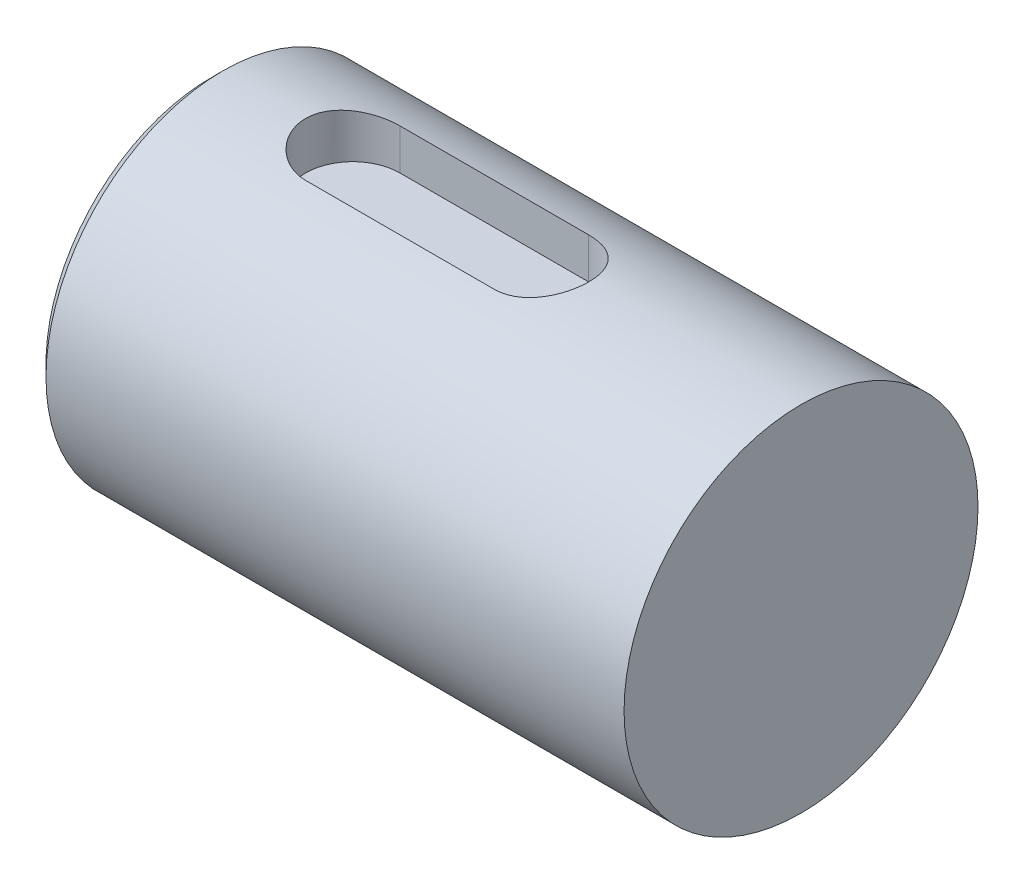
ISO-10303-21;
HEADER;
FILE_DESCRIPTION(('STEP AP214'),'2;1');
FILE_NAME('part.step','',(''),(''),'','','');
FILE_SCHEMA(('AUTOMOTIVE_DESIGN { 1 0 10303 214 1 1 1 1 }'));
ENDSEC;
DATA;
#1=APPLICATION_CONTEXT('core data for automotive mechanical design processes');
#2=APPLICATION_PROTOCOL_DEFINITION('international standard','automotive_design',2000,#1);
#3=PRODUCT_CONTEXT('',#1,'mechanical');
#4=PRODUCT('Part','Part','',(#3));
#5=PRODUCT_RELATED_PRODUCT_CATEGORY('part','',(#4));
#6=PRODUCT_DEFINITION_FORMATION('','',#4);
#7=PRODUCT_DEFINITION_CONTEXT('part definition',#1,'design');
#8=PRODUCT_DEFINITION('design','',#6,#7);
#9=PRODUCT_DEFINITION_SHAPE('','',#8);
#10=(LENGTH_UNIT() NAMED_UNIT(*) SI_UNIT(.MILLI.,.METRE.));
#11=(NAMED_UNIT(*) PLANE_ANGLE_UNIT() SI_UNIT($,.RADIAN.));
#12=(NAMED_UNIT(*) SI_UNIT($,.STERADIAN.) SOLID_ANGLE_UNIT());
#13=UNCERTAINTY_MEASURE_WITH_UNIT(LENGTH_MEASURE(1.E-05),#10,'distance_accuracy_value','');
#14=(GEOMETRIC_REPRESENTATION_CONTEXT(3) GLOBAL_UNCERTAINTY_ASSIGNED_CONTEXT((#13)) GLOBAL_UNIT_ASSIGNED_CONTEXT((#10,
#11,#12)) REPRESENTATION_CONTEXT('',''));
#15=CARTESIAN_POINT('',(0.,0.,0.));
#16=DIRECTION('',(0.,0.,1.));
#17=DIRECTION('',(1.,0.,0.));
#18=AXIS2_PLACEMENT_3D('',#15,#16,#17);
#19=CARTESIAN_POINT('',(0.,0.,0.));
#20=DIRECTION('',(1.,0.,0.));
#21=DIRECTION('',(0.,0.,-1.));
#22=AXIS2_PLACEMENT_3D('',#19,#20,#21);
#23=PLANE('',#22);
#24=CARTESIAN_POINT('',(0.,0.,0.));
#25=DIRECTION('',(1.,0.,0.));
#26=DIRECTION('',(0.,0.,-1.));
#27=AXIS2_PLACEMENT_3D('',#24,#25,#26);
#28=CIRCLE('',#27,14.);
#29=CARTESIAN_POINT('',(0.,0.,-14.));
#30=VERTEX_POINT('',#29);
#31=EDGE_CURVE('E118',#30,#30,#28,.F.);
#32=ORIENTED_EDGE('',*,*,#31,.T.);
#33=EDGE_LOOP('',(#32));
#34=FACE_BOUND('',#33,.T.);
#35=ADVANCED_FACE('F47',(#34),#23,.F.);
#36=CARTESIAN_POINT('',(0.,0.,0.));
#37=DIRECTION('',(-1.,0.,0.));
#38=DIRECTION('',(0.,0.,1.));
#39=AXIS2_PLACEMENT_3D('',#36,#37,#38);
#40=CYLINDRICAL_SURFACE('',#39,15.);
#41=DIRECTION('',(-1.,0.,0.));
#42=VECTOR('',#41,1.);
#43=CARTESIAN_POINT('',(0.,14.4568322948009,4.));
#44=LINE('',#43,#42);
#45=CARTESIAN_POINT('',(28.,14.4568322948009,3.99999999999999));
#46=VERTEX_POINT('',#45);
#47=CARTESIAN_POINT('',(12.,14.4568322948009,4.));
#48=VERTEX_POINT('',#47);
#49=EDGE_CURVE('E13',#46,#48,#44,.T.);
#50=ORIENTED_EDGE('',*,*,#49,.T.);
#51=CARTESIAN_POINT('',(12.,14.4568322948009,4.));
#52=CARTESIAN_POINT('',(11.8896417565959,14.4568189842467,4.00001309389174));
#53=CARTESIAN_POINT('',(11.7792914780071,14.4580956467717,3.99543311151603));
#54=CARTESIAN_POINT('',(11.5594213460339,14.4631301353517,3.97718874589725));
#55=CARTESIAN_POINT('',(11.4499013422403,14.4668875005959,3.96352604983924));
#56=CARTESIAN_POINT('',(11.232698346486,14.4767740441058,3.92725695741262));
#57=CARTESIAN_POINT('',(11.1250119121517,14.482898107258,3.90466984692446));
#58=CARTESIAN_POINT('',(10.9120251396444,14.4973231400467,3.85076543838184));
#59=CARTESIAN_POINT('',(10.8067248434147,14.5056241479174,3.81944798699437));
#60=CARTESIAN_POINT('',(10.4955365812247,14.5334412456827,3.71275643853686));
#61=CARTESIAN_POINT('',(10.2941250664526,14.5558829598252,3.62460332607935));
#62=CARTESIAN_POINT('',(9.90897924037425,14.6060171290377,3.41695780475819));
#63=CARTESIAN_POINT('',(9.72525079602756,14.6337113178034,3.29745504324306));
#64=CARTESIAN_POINT('',(9.37602942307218,14.6920016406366,3.02730320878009));
#65=CARTESIAN_POINT('',(9.21103815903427,14.7226489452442,2.87601544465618));
#66=CARTESIAN_POINT('',(8.90844243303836,14.7829523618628,2.54795832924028));
#67=CARTESIAN_POINT('',(8.77084241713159,14.8126083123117,2.37118484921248));
#68=CARTESIAN_POINT('',(8.52482786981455,14.8681604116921,1.99367199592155));
#69=CARTESIAN_POINT('',(8.41691603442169,14.8939887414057,1.79259414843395));
#70=CARTESIAN_POINT('',(8.23662711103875,14.9383834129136,1.3743557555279));
#71=CARTESIAN_POINT('',(8.16424235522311,14.9569513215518,1.15719869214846));
#72=CARTESIAN_POINT('',(8.05869017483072,14.9843709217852,0.718234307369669));
#73=CARTESIAN_POINT('',(8.02466278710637,14.9934353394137,0.496647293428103));
#74=CARTESIAN_POINT('',(7.99408568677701,15.0015705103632,0.0507319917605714));
#75=CARTESIAN_POINT('',(7.99753051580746,15.0006427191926,-0.173595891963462));
#76=CARTESIAN_POINT('',(8.04119568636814,14.9890534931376,-0.612629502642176));
#77=CARTESIAN_POINT('',(8.08048612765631,14.9786381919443,-0.827435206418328));
#78=CARTESIAN_POINT('',(8.19322515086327,14.9495347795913,-1.24728467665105));
#79=CARTESIAN_POINT('',(8.26667535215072,14.9308462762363,-1.45232797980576));
#80=CARTESIAN_POINT('',(8.44635996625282,14.8869312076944,-1.84920963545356));
#81=CARTESIAN_POINT('',(8.55291337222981,14.8616414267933,-2.04089626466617));
#82=CARTESIAN_POINT('',(8.79554276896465,14.8072486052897,-2.40398441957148));
#83=CARTESIAN_POINT('',(8.93162392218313,14.7781448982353,-2.57538239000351));
#84=CARTESIAN_POINT('',(9.23432797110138,14.7182294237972,-2.89854935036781));
#85=CARTESIAN_POINT('',(9.4017580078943,14.6873926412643,-3.04955722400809));
#86=CARTESIAN_POINT('',(9.76004284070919,14.6282716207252,-3.32161448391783));
#87=CARTESIAN_POINT('',(9.95090409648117,14.5999880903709,-3.44265558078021));
#88=CARTESIAN_POINT('',(10.2513532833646,14.5618587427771,-3.59932937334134));
#89=CARTESIAN_POINT('',(10.354288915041,14.5498268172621,-3.64754371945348));
#90=CARTESIAN_POINT('',(10.5640463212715,14.5275984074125,-3.73509417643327));
#91=CARTESIAN_POINT('',(10.6708665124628,14.5174011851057,-3.77443385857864));
#92=CARTESIAN_POINT('',(10.8875194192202,14.4991713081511,-3.84386783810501));
#93=CARTESIAN_POINT('',(10.997348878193,14.4911364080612,-3.87397173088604));
#94=CARTESIAN_POINT('',(11.219275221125,14.4774747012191,-3.92471856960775));
#95=CARTESIAN_POINT('',(11.33137102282,14.471846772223,-3.9453659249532));
#96=CARTESIAN_POINT('',(11.536251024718,14.4639761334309,-3.97411378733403));
#97=CARTESIAN_POINT('',(11.6287964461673,14.4613012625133,-3.98382319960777));
#98=CARTESIAN_POINT('',(11.8142253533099,14.4577275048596,-3.99676420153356));
#99=CARTESIAN_POINT('',(11.9071080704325,14.4568258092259,-4.00000603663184));
#100=CARTESIAN_POINT('',(12.,14.4568322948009,-4.));
#101=B_SPLINE_CURVE_WITH_KNOTS('',3,(#51,#52,#53,#54,#55,#56,#57,#58,#59,#60,#61,#62,#63,#64,
#65,#66,#67,#68,#69,#70,#71,#72,#73,#74,#75,#76,#77,#78,#79,#80,#81,#82,#83,#84,#85,#86,#87,#88,
#89,#90,#91,#92,#93,#94,#95,#96,#97,#98,#99,#100),.UNSPECIFIED.,.F.,.F.,(4,2,2,2,2,2,2,2,2,2,2,
2,2,2,2,2,2,2,2,2,2,2,2,2,4),(0.,0.330958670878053,0.661855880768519,0.992041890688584,
1.32223370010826,1.98190700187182,2.64179842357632,3.3164963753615,3.99130375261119,
4.67691814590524,5.36238449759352,6.03215661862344,6.70183117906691,7.35461236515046,
8.00742449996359,8.66673340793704,9.32615767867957,10.005759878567,10.6855498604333,
11.0281077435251,11.3705275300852,11.7125903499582,12.0544935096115,12.3335333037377,
12.6121307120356),.UNSPECIFIED.);
#102=CARTESIAN_POINT('',(12.,14.4568322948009,-4.00000000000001));
#103=VERTEX_POINT('',#102);
#104=EDGE_CURVE('E124',#48,#103,#101,.T.);
#105=ORIENTED_EDGE('',*,*,#104,.T.);
#106=DIRECTION('',(-1.,0.,0.));
#107=VECTOR('',#106,1.);
#108=CARTESIAN_POINT('',(0.,14.4568322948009,-4.00000000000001));
#109=LINE('',#108,#107);
#110=CARTESIAN_POINT('',(28.,14.4568322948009,-4.00000000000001));
#111=VERTEX_POINT('',#110);
#112=EDGE_CURVE('E54',#103,#111,#109,.F.);
#113=ORIENTED_EDGE('',*,*,#112,.T.);
#114=CARTESIAN_POINT('',(28.,14.4568322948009,-4.00000000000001));
#115=CARTESIAN_POINT('',(28.1103582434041,14.4568189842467,-4.00001309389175));
#116=CARTESIAN_POINT('',(28.2207085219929,14.4580956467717,-3.99543311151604));
#117=CARTESIAN_POINT('',(28.4405786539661,14.4631301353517,-3.97718874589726));
#118=CARTESIAN_POINT('',(28.5500986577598,14.4668875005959,-3.96352604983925));
#119=CARTESIAN_POINT('',(28.767301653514,14.4767740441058,-3.92725695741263));
#120=CARTESIAN_POINT('',(28.8749880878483,14.482898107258,-3.90466984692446));
#121=CARTESIAN_POINT('',(29.0879748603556,14.4973231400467,-3.85076543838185));
#122=CARTESIAN_POINT('',(29.1932751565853,14.5056241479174,-3.81944798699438));
#123=CARTESIAN_POINT('',(29.5044634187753,14.5334412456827,-3.71275643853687));
#124=CARTESIAN_POINT('',(29.7058749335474,14.5558829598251,-3.62460332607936));
#125=CARTESIAN_POINT('',(30.0910207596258,14.6060171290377,-3.4169578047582));
#126=CARTESIAN_POINT('',(30.2747492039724,14.6337113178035,-3.29745504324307));
#127=CARTESIAN_POINT('',(30.6239705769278,14.6920016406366,-3.0273032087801));
#128=CARTESIAN_POINT('',(30.7889618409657,14.7226489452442,-2.87601544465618));
#129=CARTESIAN_POINT('',(31.0915575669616,14.7829523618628,-2.54795832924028));
#130=CARTESIAN_POINT('',(31.2291575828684,14.8126083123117,-2.37118484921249));
#131=CARTESIAN_POINT('',(31.4751721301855,14.8681604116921,-1.99367199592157));
#132=CARTESIAN_POINT('',(31.5830839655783,14.8939887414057,-1.79259414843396));
#133=CARTESIAN_POINT('',(31.7633728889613,14.9383834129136,-1.3743557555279));
#134=CARTESIAN_POINT('',(31.8357576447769,14.9569513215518,-1.15719869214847));
#135=CARTESIAN_POINT('',(31.9413098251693,14.9843709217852,-0.718234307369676));
#136=CARTESIAN_POINT('',(31.9753372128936,14.9934353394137,-0.49664729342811));
#137=CARTESIAN_POINT('',(32.005914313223,15.0015705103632,-0.0507319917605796));
#138=CARTESIAN_POINT('',(32.0024694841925,15.0006427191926,0.173595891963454));
#139=CARTESIAN_POINT('',(31.9588043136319,14.9890534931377,0.612629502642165));
#140=CARTESIAN_POINT('',(31.9195138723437,14.9786381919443,0.827435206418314));
#141=CARTESIAN_POINT('',(31.8067748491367,14.9495347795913,1.24728467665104));
#142=CARTESIAN_POINT('',(31.7333246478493,14.9308462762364,1.45232797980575));
#143=CARTESIAN_POINT('',(31.5536400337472,14.8869312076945,1.84920963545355));
#144=CARTESIAN_POINT('',(31.4470866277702,14.8616414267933,2.04089626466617));
#145=CARTESIAN_POINT('',(31.2044572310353,14.8072486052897,2.40398441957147));
#146=CARTESIAN_POINT('',(31.0683760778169,14.7781448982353,2.5753823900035));
#147=CARTESIAN_POINT('',(30.7656720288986,14.7182294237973,2.8985493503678));
#148=CARTESIAN_POINT('',(30.5982419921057,14.6873926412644,3.04955722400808));
#149=CARTESIAN_POINT('',(30.2399571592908,14.6282716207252,3.32161448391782));
#150=CARTESIAN_POINT('',(30.0490959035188,14.5999880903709,3.4426555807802));
#151=CARTESIAN_POINT('',(29.7486467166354,14.5618587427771,3.59932937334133));
#152=CARTESIAN_POINT('',(29.645711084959,14.5498268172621,3.64754371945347));
#153=CARTESIAN_POINT('',(29.4359536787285,14.5275984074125,3.73509417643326));
#154=CARTESIAN_POINT('',(29.3291334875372,14.5174011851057,3.77443385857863));
#155=CARTESIAN_POINT('',(29.1124805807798,14.4991713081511,3.843867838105));
#156=CARTESIAN_POINT('',(29.002651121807,14.4911364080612,3.87397173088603));
#157=CARTESIAN_POINT('',(28.780724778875,14.4774747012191,3.92471856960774));
#158=CARTESIAN_POINT('',(28.66862897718,14.471846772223,3.94536592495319));
#159=CARTESIAN_POINT('',(28.463748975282,14.4639761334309,3.97411378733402));
#160=CARTESIAN_POINT('',(28.3712035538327,14.4613012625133,3.98382319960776));
#161=CARTESIAN_POINT('',(28.1857746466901,14.4577275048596,3.99676420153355));
#162=CARTESIAN_POINT('',(28.0928919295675,14.4568258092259,4.00000603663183));
#163=CARTESIAN_POINT('',(28.,14.4568322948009,3.99999999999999));
#164=B_SPLINE_CURVE_WITH_KNOTS('',3,(#114,#115,#116,#117,#118,#119,#120,#121,#122,#123,#124,
#125,#126,#127,#128,#129,#130,#131,#132,#133,#134,#135,#136,#137,#138,#139,#140,#141,#142,#143,
#144,#145,#146,#147,#148,#149,#150,#151,#152,#153,#154,#155,#156,#157,#158,#159,#160,#161,#162,
#163),.UNSPECIFIED.,.F.,.F.,(4,2,2,2,2,2,2,2,2,2,2,2,2,2,2,2,2,2,2,2,2,2,2,2,4),(0.,
0.330958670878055,0.661855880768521,0.992041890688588,1.32223370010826,1.98190700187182,
2.64179842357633,3.31649637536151,3.9913037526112,4.67691814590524,5.36238449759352,
6.03215661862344,6.70183117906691,7.35461236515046,8.00742449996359,8.66673340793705,
9.32615767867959,10.005759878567,10.6855498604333,11.0281077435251,11.3705275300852,
11.7125903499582,12.0544935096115,12.3335333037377,12.6121307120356),.UNSPECIFIED.);
#165=EDGE_CURVE('E61',#111,#46,#164,.T.);
#166=ORIENTED_EDGE('',*,*,#165,.T.);
#167=EDGE_LOOP('',(#50,#105,#113,#166));
#168=FACE_BOUND('',#167,.T.);
#169=CARTESIAN_POINT('',(1.,0.,0.));
#170=DIRECTION('',(1.,0.,0.));
#171=DIRECTION('',(0.,0.,-1.));
#172=AXIS2_PLACEMENT_3D('',#169,#170,#171);
#173=CIRCLE('',#172,15.);
#174=CARTESIAN_POINT('',(1.,0.,-15.));
#175=VERTEX_POINT('',#174);
#176=EDGE_CURVE('E121',#175,#175,#173,.T.);
#177=ORIENTED_EDGE('',*,*,#176,.T.);
#178=EDGE_LOOP('',(#177));
#179=FACE_BOUND('',#178,.T.);
#180=CARTESIAN_POINT('',(50.,0.,0.));
#181=DIRECTION('',(-1.,0.,0.));
#182=DIRECTION('',(0.,0.,1.));
#183=AXIS2_PLACEMENT_3D('',#180,#181,#182);
#184=CIRCLE('',#183,15.);
#185=CARTESIAN_POINT('',(50.,0.,15.));
#186=VERTEX_POINT('',#185);
#187=EDGE_CURVE('E112',#186,#186,#184,.T.);
#188=ORIENTED_EDGE('',*,*,#187,.T.);
#189=EDGE_LOOP('',(#188));
#190=FACE_BOUND('',#189,.T.);
#191=ADVANCED_FACE('F135',(#168,#179,#190),#40,.T.);
#192=CARTESIAN_POINT('',(50.,0.,0.));
#193=DIRECTION('',(-1.,0.,0.));
#194=DIRECTION('',(0.,0.,1.));
#195=AXIS2_PLACEMENT_3D('',#192,#193,#194);
#196=PLANE('',#195);
#197=ORIENTED_EDGE('',*,*,#187,.F.);
#198=EDGE_LOOP('',(#197));
#199=FACE_BOUND('',#198,.T.);
#200=ADVANCED_FACE('F152',(#199),#196,.F.);
#201=CARTESIAN_POINT('',(0.,0.,0.));
#202=DIRECTION('',(1.,0.,0.));
#203=DIRECTION('',(0.,0.,-1.));
#204=AXIS2_PLACEMENT_3D('',#201,#202,#203);
#205=CONICAL_SURFACE('',#204,14.,0.785398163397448);
#206=ORIENTED_EDGE('',*,*,#176,.F.);
#207=EDGE_LOOP('',(#206));
#208=FACE_BOUND('',#207,.T.);
#209=ORIENTED_EDGE('',*,*,#31,.F.);
#210=EDGE_LOOP('',(#209));
#211=FACE_BOUND('',#210,.T.);
#212=ADVANCED_FACE('F150',(#208,#211),#205,.T.);
#213=CARTESIAN_POINT('',(28.,11.,0.));
#214=DIRECTION('',(0.,1.,0.));
#215=DIRECTION('',(0.,0.,1.));
#216=AXIS2_PLACEMENT_3D('',#213,#214,#215);
#217=CYLINDRICAL_SURFACE('',#216,4.);
#218=DIRECTION('',(0.,1.,0.));
#219=VECTOR('',#218,1.);
#220=CARTESIAN_POINT('',(28.,11.,-4.00000000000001));
#221=LINE('',#220,#219);
#222=CARTESIAN_POINT('',(28.,11.,-4.00000000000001));
#223=VERTEX_POINT('',#222);
#224=EDGE_CURVE('E84',#223,#111,#221,.T.);
#225=ORIENTED_EDGE('',*,*,#224,.F.);
#226=CARTESIAN_POINT('',(28.,11.,0.));
#227=DIRECTION('',(0.,1.,0.));
#228=DIRECTION('',(0.,0.,-1.));
#229=AXIS2_PLACEMENT_3D('',#226,#227,#228);
#230=CIRCLE('',#229,4.);
#231=CARTESIAN_POINT('',(28.,11.,3.99999999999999));
#232=VERTEX_POINT('',#231);
#233=EDGE_CURVE('E88',#232,#223,#230,.T.);
#234=ORIENTED_EDGE('',*,*,#233,.F.);
#235=DIRECTION('',(0.,1.,0.));
#236=VECTOR('',#235,1.);
#237=CARTESIAN_POINT('',(28.,11.,3.99999999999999));
#238=LINE('',#237,#236);
#239=EDGE_CURVE('E110',#232,#46,#238,.T.);
#240=ORIENTED_EDGE('',*,*,#239,.T.);
#241=ORIENTED_EDGE('',*,*,#165,.F.);
#242=EDGE_LOOP('',(#225,#234,#240,#241));
#243=FACE_BOUND('',#242,.T.);
#244=ADVANCED_FACE('F86',(#243),#217,.F.);
#245=CARTESIAN_POINT('',(28.,11.,3.99999999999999));
#246=DIRECTION('',(0.,0.,1.));
#247=DIRECTION('',(1.,0.,0.));
#248=AXIS2_PLACEMENT_3D('',#245,#246,#247);
#249=PLANE('',#248);
#250=ORIENTED_EDGE('',*,*,#239,.F.);
#251=DIRECTION('',(1.,0.,0.));
#252=VECTOR('',#251,1.);
#253=CARTESIAN_POINT('',(28.,11.,3.99999999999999));
#254=LINE('',#253,#252);
#255=CARTESIAN_POINT('',(12.,11.,4.));
#256=VERTEX_POINT('',#255);
#257=EDGE_CURVE('E93',#256,#232,#254,.T.);
#258=ORIENTED_EDGE('',*,*,#257,.F.);
#259=DIRECTION('',(0.,1.,0.));
#260=VECTOR('',#259,1.);
#261=CARTESIAN_POINT('',(12.,11.,4.));
#262=LINE('',#261,#260);
#263=EDGE_CURVE('E113',#256,#48,#262,.T.);
#264=ORIENTED_EDGE('',*,*,#263,.T.);
#265=ORIENTED_EDGE('',*,*,#49,.F.);
#266=EDGE_LOOP('',(#250,#258,#264,#265));
#267=FACE_BOUND('',#266,.T.);
#268=ADVANCED_FACE('F143',(#267),#249,.F.);
#269=CARTESIAN_POINT('',(12.,11.,0.));
#270=DIRECTION('',(0.,1.,0.));
#271=DIRECTION('',(0.,0.,1.));
#272=AXIS2_PLACEMENT_3D('',#269,#270,#271);
#273=CYLINDRICAL_SURFACE('',#272,4.);
#274=ORIENTED_EDGE('',*,*,#263,.F.);
#275=CARTESIAN_POINT('',(12.,11.,0.));
#276=DIRECTION('',(0.,1.,0.));
#277=DIRECTION('',(0.,0.,1.));
#278=AXIS2_PLACEMENT_3D('',#275,#276,#277);
#279=CIRCLE('',#278,4.);
#280=CARTESIAN_POINT('',(12.,11.,-4.00000000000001));
#281=VERTEX_POINT('',#280);
#282=EDGE_CURVE('E102',#281,#256,#279,.T.);
#283=ORIENTED_EDGE('',*,*,#282,.F.);
#284=DIRECTION('',(0.,1.,0.));
#285=VECTOR('',#284,1.);
#286=CARTESIAN_POINT('',(12.,11.,-4.00000000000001));
#287=LINE('',#286,#285);
#288=EDGE_CURVE('E92',#281,#103,#287,.T.);
#289=ORIENTED_EDGE('',*,*,#288,.T.);
#290=ORIENTED_EDGE('',*,*,#104,.F.);
#291=EDGE_LOOP('',(#274,#283,#289,#290));
#292=FACE_BOUND('',#291,.T.);
#293=ADVANCED_FACE('F138',(#292),#273,.F.);
#294=CARTESIAN_POINT('',(28.,11.,-4.00000000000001));
#295=DIRECTION('',(0.,0.,-1.));
#296=DIRECTION('',(-1.,0.,0.));
#297=AXIS2_PLACEMENT_3D('',#294,#295,#296);
#298=PLANE('',#297);
#299=ORIENTED_EDGE('',*,*,#288,.F.);
#300=DIRECTION('',(-1.,0.,0.));
#301=VECTOR('',#300,1.);
#302=CARTESIAN_POINT('',(28.,11.,-4.00000000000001));
#303=LINE('',#302,#301);
#304=EDGE_CURVE('E96',#223,#281,#303,.T.);
#305=ORIENTED_EDGE('',*,*,#304,.F.);
#306=ORIENTED_EDGE('',*,*,#224,.T.);
#307=ORIENTED_EDGE('',*,*,#112,.F.);
#308=EDGE_LOOP('',(#299,#305,#306,#307));
#309=FACE_BOUND('',#308,.T.);
#310=ADVANCED_FACE('F97',(#309),#298,.F.);
#311=CARTESIAN_POINT('',(28.,11.,0.));
#312=DIRECTION('',(0.,-1.,0.));
#313=DIRECTION('',(0.,0.,-1.));
#314=AXIS2_PLACEMENT_3D('',#311,#312,#313);
#315=PLANE('',#314);
#316=ORIENTED_EDGE('',*,*,#233,.T.);
#317=ORIENTED_EDGE('',*,*,#304,.T.);
#318=ORIENTED_EDGE('',*,*,#282,.T.);
#319=ORIENTED_EDGE('',*,*,#257,.T.);
#320=EDGE_LOOP('',(#316,#317,#318,#319));
#321=FACE_BOUND('',#320,.T.);
#322=ADVANCED_FACE('F104',(#321),#315,.F.);
#323=CLOSED_SHELL('',(#35,#191,#200,#212,#244,#268,#293,#310,#322));
#324=MANIFOLD_SOLID_BREP('B2',#323);
#325=ADVANCED_BREP_SHAPE_REPRESENTATION('',(#18,#324),#14);
#326=SHAPE_DEFINITION_REPRESENTATION(#9,#325);
ENDSEC;
END-ISO-10303-21;
